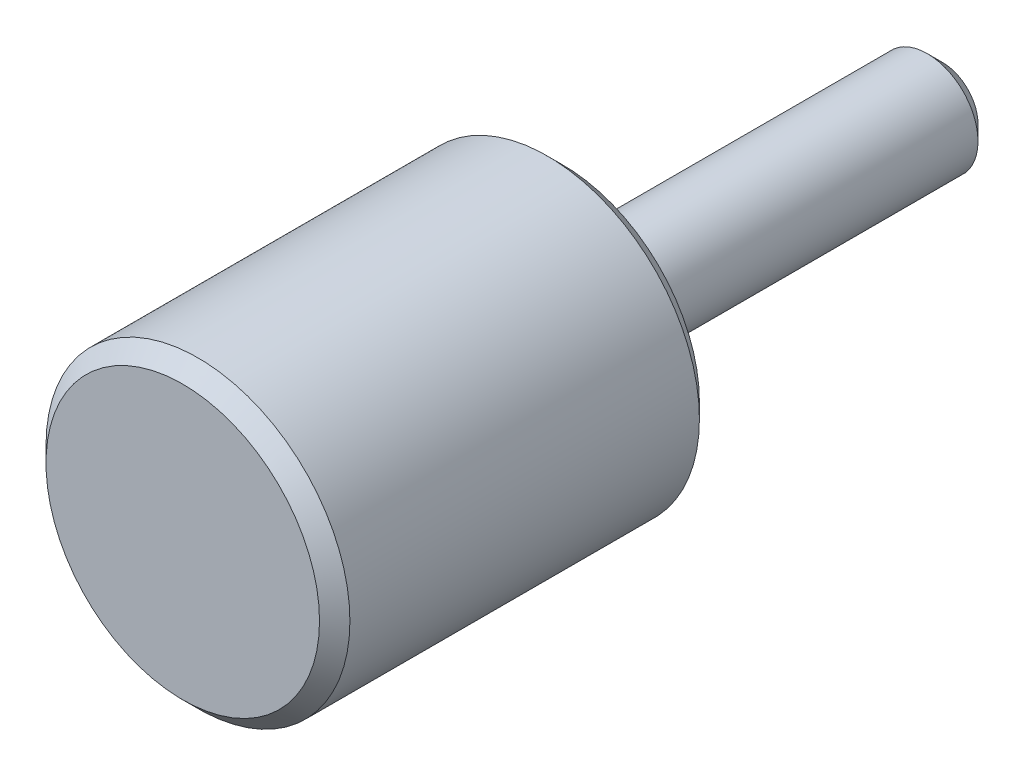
ISO-10303-21;
HEADER;
FILE_DESCRIPTION(('STEP AP214'),'2;1');
FILE_NAME('part.step','',(''),(''),'','','');
FILE_SCHEMA(('AUTOMOTIVE_DESIGN { 1 0 10303 214 1 1 1 1 }'));
ENDSEC;
DATA;
#1=APPLICATION_CONTEXT('core data for automotive mechanical design processes');
#2=APPLICATION_PROTOCOL_DEFINITION('international standard','automotive_design',2000,#1);
#3=PRODUCT_CONTEXT('',#1,'mechanical');
#4=PRODUCT('Part','Part','',(#3));
#5=PRODUCT_RELATED_PRODUCT_CATEGORY('part','',(#4));
#6=PRODUCT_DEFINITION_FORMATION('','',#4);
#7=PRODUCT_DEFINITION_CONTEXT('part definition',#1,'design');
#8=PRODUCT_DEFINITION('design','',#6,#7);
#9=PRODUCT_DEFINITION_SHAPE('','',#8);
#10=(LENGTH_UNIT() NAMED_UNIT(*) SI_UNIT(.MILLI.,.METRE.));
#11=(NAMED_UNIT(*) PLANE_ANGLE_UNIT() SI_UNIT($,.RADIAN.));
#12=(NAMED_UNIT(*) SI_UNIT($,.STERADIAN.) SOLID_ANGLE_UNIT());
#13=UNCERTAINTY_MEASURE_WITH_UNIT(LENGTH_MEASURE(1.E-05),#10,'distance_accuracy_value','');
#14=(GEOMETRIC_REPRESENTATION_CONTEXT(3) GLOBAL_UNCERTAINTY_ASSIGNED_CONTEXT((#13)) GLOBAL_UNIT_ASSIGNED_CONTEXT((#10,
#11,#12)) REPRESENTATION_CONTEXT('',''));
#15=CARTESIAN_POINT('',(0.,0.,0.));
#16=DIRECTION('',(0.,0.,1.));
#17=DIRECTION('',(1.,0.,0.));
#18=AXIS2_PLACEMENT_3D('',#15,#16,#17);
#19=CARTESIAN_POINT('',(0.,0.,30.));
#20=DIRECTION('',(0.,0.,-1.));
#21=DIRECTION('',(-1.,0.,0.));
#22=AXIS2_PLACEMENT_3D('',#19,#20,#21);
#23=CYLINDRICAL_SURFACE('',#22,12.);
#24=CARTESIAN_POINT('',(0.,0.,28.8));
#25=DIRECTION('',(0.,0.,1.));
#26=DIRECTION('',(1.,0.,0.));
#27=AXIS2_PLACEMENT_3D('',#24,#25,#26);
#28=CIRCLE('',#27,12.);
#29=CARTESIAN_POINT('',(12.,0.,28.8));
#30=VERTEX_POINT('',#29);
#31=EDGE_CURVE('E24',#30,#30,#28,.F.);
#32=ORIENTED_EDGE('',*,*,#31,.T.);
#33=EDGE_LOOP('',(#32));
#34=FACE_BOUND('',#33,.T.);
#35=CARTESIAN_POINT('',(0.,0.,1.2));
#36=DIRECTION('',(0.,0.,1.));
#37=DIRECTION('',(1.,0.,0.));
#38=AXIS2_PLACEMENT_3D('',#35,#36,#37);
#39=CIRCLE('',#38,12.);
#40=CARTESIAN_POINT('',(12.,0.,1.2));
#41=VERTEX_POINT('',#40);
#42=EDGE_CURVE('E35',#41,#41,#39,.T.);
#43=ORIENTED_EDGE('',*,*,#42,.T.);
#44=EDGE_LOOP('',(#43));
#45=FACE_BOUND('',#44,.T.);
#46=ADVANCED_FACE('F12',(#34,#45),#23,.T.);
#47=CARTESIAN_POINT('',(0.,0.,30.));
#48=DIRECTION('',(0.,0.,1.));
#49=DIRECTION('',(1.,0.,0.));
#50=AXIS2_PLACEMENT_3D('',#47,#48,#49);
#51=PLANE('',#50);
#52=CARTESIAN_POINT('',(0.,0.,30.));
#53=DIRECTION('',(0.,0.,1.));
#54=DIRECTION('',(1.,0.,0.));
#55=AXIS2_PLACEMENT_3D('',#52,#53,#54);
#56=CIRCLE('',#55,10.8);
#57=CARTESIAN_POINT('',(10.8,0.,30.));
#58=VERTEX_POINT('',#57);
#59=EDGE_CURVE('E29',#58,#58,#56,.T.);
#60=ORIENTED_EDGE('',*,*,#59,.T.);
#61=EDGE_LOOP('',(#60));
#62=FACE_BOUND('',#61,.T.);
#63=ADVANCED_FACE('F47',(#62),#51,.T.);
#64=CARTESIAN_POINT('',(0.,0.,0.));
#65=DIRECTION('',(0.,0.,1.));
#66=DIRECTION('',(1.,0.,0.));
#67=AXIS2_PLACEMENT_3D('',#64,#65,#66);
#68=PLANE('',#67);
#69=CARTESIAN_POINT('',(0.,0.,0.));
#70=DIRECTION('',(0.,0.,1.));
#71=DIRECTION('',(1.,0.,0.));
#72=AXIS2_PLACEMENT_3D('',#69,#70,#71);
#73=CIRCLE('',#72,10.8);
#74=CARTESIAN_POINT('',(10.8,0.,0.));
#75=VERTEX_POINT('',#74);
#76=EDGE_CURVE('E32',#75,#75,#73,.F.);
#77=ORIENTED_EDGE('',*,*,#76,.T.);
#78=EDGE_LOOP('',(#77));
#79=FACE_BOUND('',#78,.T.);
#80=CARTESIAN_POINT('',(0.,0.,0.));
#81=DIRECTION('',(0.,0.,-1.));
#82=DIRECTION('',(-1.,0.,0.));
#83=AXIS2_PLACEMENT_3D('',#80,#81,#82);
#84=CIRCLE('',#83,4.);
#85=CARTESIAN_POINT('',(-4.,0.,0.));
#86=VERTEX_POINT('',#85);
#87=EDGE_CURVE('E16',#86,#86,#84,.T.);
#88=ORIENTED_EDGE('',*,*,#87,.F.);
#89=EDGE_LOOP('',(#88));
#90=FACE_BOUND('',#89,.T.);
#91=ADVANCED_FACE('F44',(#79,#90),#68,.F.);
#92=CARTESIAN_POINT('',(0.,0.,1.2));
#93=DIRECTION('',(0.,0.,1.));
#94=DIRECTION('',(1.,0.,0.));
#95=AXIS2_PLACEMENT_3D('',#92,#93,#94);
#96=CONICAL_SURFACE('',#95,12.,0.78539816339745);
#97=ORIENTED_EDGE('',*,*,#76,.F.);
#98=EDGE_LOOP('',(#97));
#99=FACE_BOUND('',#98,.T.);
#100=ORIENTED_EDGE('',*,*,#42,.F.);
#101=EDGE_LOOP('',(#100));
#102=FACE_BOUND('',#101,.T.);
#103=ADVANCED_FACE('F46',(#99,#102),#96,.T.);
#104=CARTESIAN_POINT('',(0.,0.,30.));
#105=DIRECTION('',(0.,0.,-1.));
#106=DIRECTION('',(-1.,0.,0.));
#107=AXIS2_PLACEMENT_3D('',#104,#105,#106);
#108=CONICAL_SURFACE('',#107,10.8,0.785398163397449);
#109=ORIENTED_EDGE('',*,*,#31,.F.);
#110=EDGE_LOOP('',(#109));
#111=FACE_BOUND('',#110,.T.);
#112=ORIENTED_EDGE('',*,*,#59,.F.);
#113=EDGE_LOOP('',(#112));
#114=FACE_BOUND('',#113,.T.);
#115=ADVANCED_FACE('F55',(#111,#114),#108,.T.);
#116=CARTESIAN_POINT('',(0.,0.,-30.));
#117=DIRECTION('',(0.,0.,1.));
#118=DIRECTION('',(1.,0.,0.));
#119=AXIS2_PLACEMENT_3D('',#116,#117,#118);
#120=PLANE('',#119);
#121=CARTESIAN_POINT('',(0.,0.,-30.));
#122=DIRECTION('',(0.,0.,1.));
#123=DIRECTION('',(1.,0.,0.));
#124=AXIS2_PLACEMENT_3D('',#121,#122,#123);
#125=CIRCLE('',#124,2.8);
#126=CARTESIAN_POINT('',(2.8,0.,-30.));
#127=VERTEX_POINT('',#126);
#128=EDGE_CURVE('E8',#127,#127,#125,.F.);
#129=ORIENTED_EDGE('',*,*,#128,.T.);
#130=EDGE_LOOP('',(#129));
#131=FACE_BOUND('',#130,.T.);
#132=ADVANCED_FACE('F68',(#131),#120,.F.);
#133=CARTESIAN_POINT('',(0.,0.,-28.8));
#134=DIRECTION('',(0.,0.,1.));
#135=DIRECTION('',(1.,0.,0.));
#136=AXIS2_PLACEMENT_3D('',#133,#134,#135);
#137=CONICAL_SURFACE('',#136,4.,0.78539816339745);
#138=ORIENTED_EDGE('',*,*,#128,.F.);
#139=EDGE_LOOP('',(#138));
#140=FACE_BOUND('',#139,.T.);
#141=CARTESIAN_POINT('',(0.,0.,-28.8));
#142=DIRECTION('',(0.,0.,1.));
#143=DIRECTION('',(1.,0.,0.));
#144=AXIS2_PLACEMENT_3D('',#141,#142,#143);
#145=CIRCLE('',#144,4.);
#146=CARTESIAN_POINT('',(4.,0.,-28.8));
#147=VERTEX_POINT('',#146);
#148=EDGE_CURVE('E20',#147,#147,#145,.T.);
#149=ORIENTED_EDGE('',*,*,#148,.F.);
#150=EDGE_LOOP('',(#149));
#151=FACE_BOUND('',#150,.T.);
#152=ADVANCED_FACE('F66',(#140,#151),#137,.T.);
#153=CARTESIAN_POINT('',(0.,0.,15.));
#154=DIRECTION('',(0.,0.,-1.));
#155=DIRECTION('',(-1.,0.,0.));
#156=AXIS2_PLACEMENT_3D('',#153,#154,#155);
#157=CYLINDRICAL_SURFACE('',#156,4.);
#158=ORIENTED_EDGE('',*,*,#87,.T.);
#159=EDGE_LOOP('',(#158));
#160=FACE_BOUND('',#159,.T.);
#161=ORIENTED_EDGE('',*,*,#148,.T.);
#162=EDGE_LOOP('',(#161));
#163=FACE_BOUND('',#162,.T.);
#164=ADVANCED_FACE('F14',(#160,#163),#157,.T.);
#165=CLOSED_SHELL('',(#46,#63,#91,#103,#115,#132,#152,#164));
#166=MANIFOLD_SOLID_BREP('B1',#165);
#167=ADVANCED_BREP_SHAPE_REPRESENTATION('',(#18,#166),#14);
#168=SHAPE_DEFINITION_REPRESENTATION(#9,#167);
ENDSEC;
END-ISO-10303-21;
